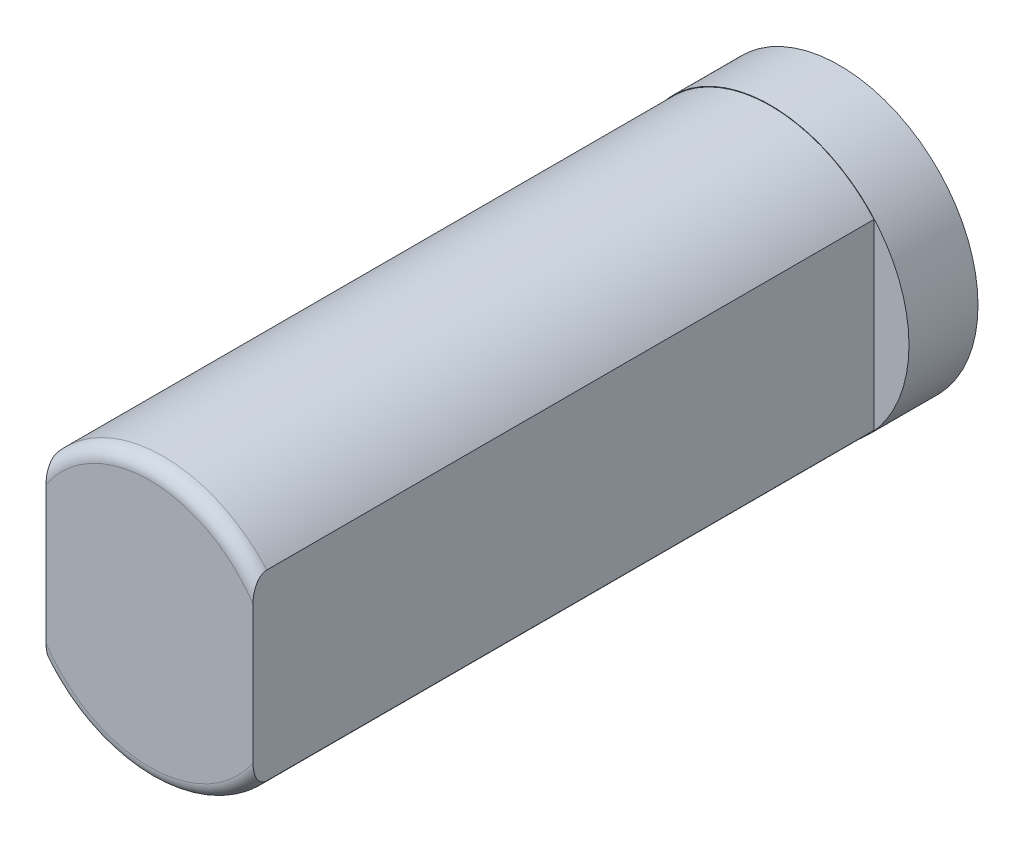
ISO-10303-21;
HEADER;
FILE_DESCRIPTION(('STEP AP214'),'2;1');
FILE_NAME('part.step','',(''),(''),'','','');
FILE_SCHEMA(('AUTOMOTIVE_DESIGN { 1 0 10303 214 1 1 1 1 }'));
ENDSEC;
DATA;
#1=APPLICATION_CONTEXT('core data for automotive mechanical design processes');
#2=APPLICATION_PROTOCOL_DEFINITION('international standard','automotive_design',2000,#1);
#3=PRODUCT_CONTEXT('',#1,'mechanical');
#4=PRODUCT('Part','Part','',(#3));
#5=PRODUCT_RELATED_PRODUCT_CATEGORY('part','',(#4));
#6=PRODUCT_DEFINITION_FORMATION('','',#4);
#7=PRODUCT_DEFINITION_CONTEXT('part definition',#1,'design');
#8=PRODUCT_DEFINITION('design','',#6,#7);
#9=PRODUCT_DEFINITION_SHAPE('','',#8);
#10=(LENGTH_UNIT() NAMED_UNIT(*) SI_UNIT(.MILLI.,.METRE.));
#11=(NAMED_UNIT(*) PLANE_ANGLE_UNIT() SI_UNIT($,.RADIAN.));
#12=(NAMED_UNIT(*) SI_UNIT($,.STERADIAN.) SOLID_ANGLE_UNIT());
#13=UNCERTAINTY_MEASURE_WITH_UNIT(LENGTH_MEASURE(1.E-05),#10,'distance_accuracy_value','');
#14=(GEOMETRIC_REPRESENTATION_CONTEXT(3) GLOBAL_UNCERTAINTY_ASSIGNED_CONTEXT((#13)) GLOBAL_UNIT_ASSIGNED_CONTEXT((#10,
#11,#12)) REPRESENTATION_CONTEXT('',''));
#15=CARTESIAN_POINT('',(0.,0.,0.));
#16=DIRECTION('',(0.,0.,1.));
#17=DIRECTION('',(1.,0.,0.));
#18=AXIS2_PLACEMENT_3D('',#15,#16,#17);
#19=CARTESIAN_POINT('',(0.,0.,10.));
#20=DIRECTION('',(0.,0.,-1.));
#21=DIRECTION('',(-1.,0.,0.));
#22=AXIS2_PLACEMENT_3D('',#19,#20,#21);
#23=CYLINDRICAL_SURFACE('',#22,2.);
#24=CARTESIAN_POINT('',(0.,0.,0.999999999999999));
#25=DIRECTION('',(0.,0.,-1.));
#26=DIRECTION('',(-1.,0.,0.));
#27=AXIS2_PLACEMENT_3D('',#24,#25,#26);
#28=CIRCLE('',#27,2.);
#29=CARTESIAN_POINT('',(-1.5,1.32287565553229,0.999999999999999));
#30=VERTEX_POINT('',#29);
#31=CARTESIAN_POINT('',(1.5,1.3228756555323,0.999999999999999));
#32=VERTEX_POINT('',#31);
#33=EDGE_CURVE('E48',#30,#32,#28,.T.);
#34=ORIENTED_EDGE('',*,*,#33,.F.);
#35=DIRECTION('',(0.,0.,-1.));
#36=VECTOR('',#35,1.);
#37=CARTESIAN_POINT('',(-1.5,1.32287565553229,10.));
#38=LINE('',#37,#36);
#39=CARTESIAN_POINT('',(-1.5,1.32287565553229,9.8));
#40=VERTEX_POINT('',#39);
#41=EDGE_CURVE('E117',#40,#30,#38,.T.);
#42=ORIENTED_EDGE('',*,*,#41,.F.);
#43=CARTESIAN_POINT('',(0.,0.,9.8));
#44=DIRECTION('',(0.,0.,1.));
#45=DIRECTION('',(1.,0.,0.));
#46=AXIS2_PLACEMENT_3D('',#43,#44,#45);
#47=CIRCLE('',#46,2.);
#48=CARTESIAN_POINT('',(1.5,1.3228756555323,9.8));
#49=VERTEX_POINT('',#48);
#50=EDGE_CURVE('E41',#40,#49,#47,.F.);
#51=ORIENTED_EDGE('',*,*,#50,.T.);
#52=DIRECTION('',(0.,0.,-1.));
#53=VECTOR('',#52,1.);
#54=CARTESIAN_POINT('',(1.5,1.3228756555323,10.));
#55=LINE('',#54,#53);
#56=EDGE_CURVE('E97',#49,#32,#55,.T.);
#57=ORIENTED_EDGE('',*,*,#56,.T.);
#58=EDGE_LOOP('',(#34,#42,#51,#57));
#59=FACE_BOUND('',#58,.T.);
#60=ADVANCED_FACE('F32',(#59),#23,.T.);
#61=CARTESIAN_POINT('',(-1.5,1.32287565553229,10.));
#62=DIRECTION('',(1.,0.,0.));
#63=DIRECTION('',(0.,0.,-1.));
#64=AXIS2_PLACEMENT_3D('',#61,#62,#63);
#65=PLANE('',#64);
#66=DIRECTION('',(0.,1.,0.));
#67=VECTOR('',#66,1.);
#68=CARTESIAN_POINT('',(-1.5,1.32287565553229,0.999999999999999));
#69=LINE('',#68,#67);
#70=CARTESIAN_POINT('',(-1.5,-1.32287565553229,0.999999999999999));
#71=VERTEX_POINT('',#70);
#72=EDGE_CURVE('E55',#71,#30,#69,.T.);
#73=ORIENTED_EDGE('',*,*,#72,.F.);
#74=DIRECTION('',(0.,0.,-1.));
#75=VECTOR('',#74,1.);
#76=CARTESIAN_POINT('',(-1.5,-1.32287565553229,10.));
#77=LINE('',#76,#75);
#78=CARTESIAN_POINT('',(-1.5,-1.32287565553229,9.8));
#79=VERTEX_POINT('',#78);
#80=EDGE_CURVE('E96',#79,#71,#77,.T.);
#81=ORIENTED_EDGE('',*,*,#80,.F.);
#82=CARTESIAN_POINT('',(-1.5,-1.32287565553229,9.8));
#83=CARTESIAN_POINT('',(-1.5,-1.32289734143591,9.80855991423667));
#84=CARTESIAN_POINT('',(-1.5,-1.32204643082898,9.81709616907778));
#85=CARTESIAN_POINT('',(-1.5,-1.31878936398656,9.83378765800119));
#86=CARTESIAN_POINT('',(-1.5,-1.31639779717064,9.84194570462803));
#87=CARTESIAN_POINT('',(-1.5,-1.31025251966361,9.85769231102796));
#88=CARTESIAN_POINT('',(-1.5,-1.30650297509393,9.86528252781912));
#89=CARTESIAN_POINT('',(-1.5,-1.29787951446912,9.87980807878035));
#90=CARTESIAN_POINT('',(-1.5,-1.29300286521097,9.88674176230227));
#91=CARTESIAN_POINT('',(-1.5,-1.28003921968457,9.90274983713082));
#92=CARTESIAN_POINT('',(-1.5,-1.27147928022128,9.91144049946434));
#93=CARTESIAN_POINT('',(-1.5,-1.25309795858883,9.92734906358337));
#94=CARTESIAN_POINT('',(-1.5,-1.24327456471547,9.93456456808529));
#95=CARTESIAN_POINT('',(-1.5,-1.2175420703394,9.95097970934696));
#96=CARTESIAN_POINT('',(-1.5,-1.20108425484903,9.95931459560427));
#97=CARTESIAN_POINT('',(-1.5,-1.16705594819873,9.97339027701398));
#98=CARTESIAN_POINT('',(-1.5,-1.1494806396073,9.97911883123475));
#99=CARTESIAN_POINT('',(-1.5,-1.10920343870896,9.98955134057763));
#100=CARTESIAN_POINT('',(-1.5,-1.08634119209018,9.99361733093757));
#101=CARTESIAN_POINT('',(-1.5,-1.04061534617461,9.99880491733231));
#102=CARTESIAN_POINT('',(-1.5,-1.01775676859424,9.99996917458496));
#103=CARTESIAN_POINT('',(-1.5,-0.994987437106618,10.));
#104=B_SPLINE_CURVE_WITH_KNOTS('',3,(#82,#83,#84,#85,#86,#87,#88,#89,#90,#91,#92,#93,#94,#95,
#96,#97,#98,#99,#100,#101,#102,#103),.UNSPECIFIED.,.F.,.F.,(4,2,2,2,2,2,2,2,2,2,4),(0.,
0.0256000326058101,0.0509611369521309,0.0762450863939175,0.10159100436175,0.137981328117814,
0.174430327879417,0.229467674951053,0.284760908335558,0.354212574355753,0.422636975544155),.UNSPECIFIED.);
#105=CARTESIAN_POINT('',(-1.5,-0.994987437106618,10.));
#106=VERTEX_POINT('',#105);
#107=EDGE_CURVE('E156',#79,#106,#104,.T.);
#108=ORIENTED_EDGE('',*,*,#107,.T.);
#109=DIRECTION('',(0.,-1.,0.));
#110=VECTOR('',#109,1.);
#111=CARTESIAN_POINT('',(-1.5,1.32287565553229,10.));
#112=LINE('',#111,#110);
#113=CARTESIAN_POINT('',(-1.5,0.994987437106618,10.));
#114=VERTEX_POINT('',#113);
#115=EDGE_CURVE('E106',#114,#106,#112,.T.);
#116=ORIENTED_EDGE('',*,*,#115,.F.);
#117=CARTESIAN_POINT('',(-1.5,0.994987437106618,10.));
#118=CARTESIAN_POINT('',(-1.5,1.01108869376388,9.99999272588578));
#119=CARTESIAN_POINT('',(-1.5,1.02720569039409,9.99940483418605));
#120=CARTESIAN_POINT('',(-1.5,1.05943512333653,9.99688940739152));
#121=CARTESIAN_POINT('',(-1.5,1.07554688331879,9.99495340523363));
#122=CARTESIAN_POINT('',(-1.5,1.1077519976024,9.98952027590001));
#123=CARTESIAN_POINT('',(-1.5,1.12384175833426,9.98600110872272));
#124=CARTESIAN_POINT('',(-1.5,1.15548512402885,9.97716145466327));
#125=CARTESIAN_POINT('',(-1.5,1.17104016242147,9.9718462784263));
#126=CARTESIAN_POINT('',(-1.5,1.1977280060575,9.96060993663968));
#127=CARTESIAN_POINT('',(-1.5,1.20904227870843,9.9551233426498));
#128=CARTESIAN_POINT('',(-1.5,1.23088528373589,9.94277185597));
#129=CARTESIAN_POINT('',(-1.5,1.24141517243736,9.9359090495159));
#130=CARTESIAN_POINT('',(-1.5,1.26146150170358,9.92055000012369));
#131=CARTESIAN_POINT('',(-1.5,1.27096207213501,9.912032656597));
#132=CARTESIAN_POINT('',(-1.5,1.28818030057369,9.89334599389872));
#133=CARTESIAN_POINT('',(-1.5,1.29590320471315,9.88318169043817));
#134=CARTESIAN_POINT('',(-1.5,1.3064363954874,9.86536546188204));
#135=CARTESIAN_POINT('',(-1.5,1.3100091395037,9.85816236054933));
#136=CARTESIAN_POINT('',(-1.5,1.31593198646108,9.84327456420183));
#137=CARTESIAN_POINT('',(-1.5,1.31828469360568,9.83559093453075));
#138=CARTESIAN_POINT('',(-1.5,1.32091350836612,9.8232069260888));
#139=CARTESIAN_POINT('',(-1.5,1.32164649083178,9.81859992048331));
#140=CARTESIAN_POINT('',(-1.5,1.32262860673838,9.80932969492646));
#141=CARTESIAN_POINT('',(-1.5,1.32287720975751,9.80466641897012));
#142=CARTESIAN_POINT('',(-1.5,1.32287565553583,9.80000000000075));
#143=B_SPLINE_CURVE_WITH_KNOTS('',3,(#117,#118,#119,#120,#121,#122,#123,#124,#125,#126,#127,
#128,#129,#130,#131,#132,#133,#134,#135,#136,#137,#138,#139,#140,#141,#142),.UNSPECIFIED.,.F.,
.F.,(4,2,2,2,2,2,2,2,2,2,2,2,4),(0.,0.0483174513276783,0.0969411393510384,0.146263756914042,
0.195441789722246,0.23308465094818,0.270670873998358,0.308772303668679,0.346759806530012,
0.370791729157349,0.394772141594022,0.408743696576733,0.422730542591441),.UNSPECIFIED.);
#144=EDGE_CURVE('E151',#114,#40,#143,.T.);
#145=ORIENTED_EDGE('',*,*,#144,.T.);
#146=ORIENTED_EDGE('',*,*,#41,.T.);
#147=EDGE_LOOP('',(#73,#81,#108,#116,#145,#146));
#148=FACE_BOUND('',#147,.T.);
#149=ADVANCED_FACE('F145',(#148),#65,.F.);
#150=CARTESIAN_POINT('',(0.,0.,10.));
#151=DIRECTION('',(0.,0.,-1.));
#152=DIRECTION('',(-1.,0.,0.));
#153=AXIS2_PLACEMENT_3D('',#150,#151,#152);
#154=CYLINDRICAL_SURFACE('',#153,2.);
#155=CARTESIAN_POINT('',(0.,0.,0.999999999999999));
#156=DIRECTION('',(0.,0.,-1.));
#157=DIRECTION('',(-1.,0.,0.));
#158=AXIS2_PLACEMENT_3D('',#155,#156,#157);
#159=CIRCLE('',#158,2.);
#160=CARTESIAN_POINT('',(1.5,-1.3228756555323,0.999999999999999));
#161=VERTEX_POINT('',#160);
#162=EDGE_CURVE('E100',#161,#71,#159,.T.);
#163=ORIENTED_EDGE('',*,*,#162,.F.);
#164=DIRECTION('',(0.,0.,-1.));
#165=VECTOR('',#164,1.);
#166=CARTESIAN_POINT('',(1.5,-1.3228756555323,10.));
#167=LINE('',#166,#165);
#168=CARTESIAN_POINT('',(1.5,-1.3228756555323,9.8));
#169=VERTEX_POINT('',#168);
#170=EDGE_CURVE('E88',#169,#161,#167,.T.);
#171=ORIENTED_EDGE('',*,*,#170,.F.);
#172=CARTESIAN_POINT('',(0.,0.,9.8));
#173=DIRECTION('',(0.,0.,1.));
#174=DIRECTION('',(1.,0.,0.));
#175=AXIS2_PLACEMENT_3D('',#172,#173,#174);
#176=CIRCLE('',#175,2.);
#177=EDGE_CURVE('E252',#169,#79,#176,.F.);
#178=ORIENTED_EDGE('',*,*,#177,.T.);
#179=ORIENTED_EDGE('',*,*,#80,.T.);
#180=EDGE_LOOP('',(#163,#171,#178,#179));
#181=FACE_BOUND('',#180,.T.);
#182=ADVANCED_FACE('F101',(#181),#154,.T.);
#183=CARTESIAN_POINT('',(1.5,1.3228756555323,10.));
#184=DIRECTION('',(-1.,0.,0.));
#185=DIRECTION('',(0.,0.,1.));
#186=AXIS2_PLACEMENT_3D('',#183,#184,#185);
#187=PLANE('',#186);
#188=DIRECTION('',(0.,-1.,0.));
#189=VECTOR('',#188,1.);
#190=CARTESIAN_POINT('',(1.5,1.3228756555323,0.999999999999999));
#191=LINE('',#190,#189);
#192=EDGE_CURVE('E11',#32,#161,#191,.T.);
#193=ORIENTED_EDGE('',*,*,#192,.F.);
#194=ORIENTED_EDGE('',*,*,#56,.F.);
#195=CARTESIAN_POINT('',(1.5,1.3228756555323,9.8));
#196=CARTESIAN_POINT('',(1.5,1.32289734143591,9.80855991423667));
#197=CARTESIAN_POINT('',(1.5,1.32204643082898,9.81709616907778));
#198=CARTESIAN_POINT('',(1.5,1.31878936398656,9.83378765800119));
#199=CARTESIAN_POINT('',(1.5,1.31639779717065,9.84194570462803));
#200=CARTESIAN_POINT('',(1.5,1.31025251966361,9.85769231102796));
#201=CARTESIAN_POINT('',(1.5,1.30650297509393,9.86528252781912));
#202=CARTESIAN_POINT('',(1.5,1.29787951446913,9.87980807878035));
#203=CARTESIAN_POINT('',(1.5,1.29300286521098,9.88674176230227));
#204=CARTESIAN_POINT('',(1.5,1.28003921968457,9.90274983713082));
#205=CARTESIAN_POINT('',(1.5,1.27147928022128,9.91144049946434));
#206=CARTESIAN_POINT('',(1.5,1.25309795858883,9.92734906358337));
#207=CARTESIAN_POINT('',(1.5,1.24327456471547,9.93456456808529));
#208=CARTESIAN_POINT('',(1.5,1.2175420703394,9.95097970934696));
#209=CARTESIAN_POINT('',(1.5,1.20108425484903,9.95931459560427));
#210=CARTESIAN_POINT('',(1.5,1.16705594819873,9.97339027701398));
#211=CARTESIAN_POINT('',(1.5,1.1494806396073,9.97911883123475));
#212=CARTESIAN_POINT('',(1.5,1.10920343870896,9.98955134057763));
#213=CARTESIAN_POINT('',(1.5,1.08634119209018,9.99361733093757));
#214=CARTESIAN_POINT('',(1.5,1.04061534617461,9.99880491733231));
#215=CARTESIAN_POINT('',(1.5,1.01775676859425,9.99996917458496));
#216=CARTESIAN_POINT('',(1.5,0.99498743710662,10.));
#217=B_SPLINE_CURVE_WITH_KNOTS('',3,(#195,#196,#197,#198,#199,#200,#201,#202,#203,#204,#205,
#206,#207,#208,#209,#210,#211,#212,#213,#214,#215,#216),.UNSPECIFIED.,.F.,.F.,(4,2,2,2,2,2,2,2,
2,2,4),(0.,0.0256000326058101,0.0509611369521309,0.0762450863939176,0.10159100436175,
0.137981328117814,0.174430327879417,0.229467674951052,0.284760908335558,0.354212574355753,
0.422636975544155),.UNSPECIFIED.);
#218=CARTESIAN_POINT('',(1.5,0.99498743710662,10.));
#219=VERTEX_POINT('',#218);
#220=EDGE_CURVE('E125',#49,#219,#217,.T.);
#221=ORIENTED_EDGE('',*,*,#220,.T.);
#222=DIRECTION('',(0.,1.,0.));
#223=VECTOR('',#222,1.);
#224=CARTESIAN_POINT('',(1.5,1.3228756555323,10.));
#225=LINE('',#224,#223);
#226=CARTESIAN_POINT('',(1.5,-0.994987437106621,10.));
#227=VERTEX_POINT('',#226);
#228=EDGE_CURVE('E109',#227,#219,#225,.T.);
#229=ORIENTED_EDGE('',*,*,#228,.F.);
#230=CARTESIAN_POINT('',(1.5,-0.99498743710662,10.));
#231=CARTESIAN_POINT('',(1.5,-1.01108869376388,9.99999272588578));
#232=CARTESIAN_POINT('',(1.5,-1.02720569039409,9.99940483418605));
#233=CARTESIAN_POINT('',(1.5,-1.05943512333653,9.99688940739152));
#234=CARTESIAN_POINT('',(1.5,-1.0755468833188,9.99495340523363));
#235=CARTESIAN_POINT('',(1.5,-1.1077519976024,9.98952027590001));
#236=CARTESIAN_POINT('',(1.5,-1.12384175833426,9.98600110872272));
#237=CARTESIAN_POINT('',(1.5,-1.15548512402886,9.97716145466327));
#238=CARTESIAN_POINT('',(1.5,-1.17104016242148,9.9718462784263));
#239=CARTESIAN_POINT('',(1.5,-1.1977280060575,9.96060993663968));
#240=CARTESIAN_POINT('',(1.5,-1.20904227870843,9.9551233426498));
#241=CARTESIAN_POINT('',(1.5,-1.2308852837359,9.94277185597));
#242=CARTESIAN_POINT('',(1.5,-1.24141517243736,9.9359090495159));
#243=CARTESIAN_POINT('',(1.5,-1.26146150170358,9.92055000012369));
#244=CARTESIAN_POINT('',(1.5,-1.27096207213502,9.912032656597));
#245=CARTESIAN_POINT('',(1.5,-1.2881803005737,9.89334599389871));
#246=CARTESIAN_POINT('',(1.5,-1.29590320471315,9.88318169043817));
#247=CARTESIAN_POINT('',(1.5,-1.3064363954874,9.86536546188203));
#248=CARTESIAN_POINT('',(1.5,-1.31000913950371,9.85816236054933));
#249=CARTESIAN_POINT('',(1.5,-1.31593198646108,9.84327456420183));
#250=CARTESIAN_POINT('',(1.5,-1.31828469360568,9.83559093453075));
#251=CARTESIAN_POINT('',(1.5,-1.32091350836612,9.82320692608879));
#252=CARTESIAN_POINT('',(1.5,-1.32164649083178,9.81859992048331));
#253=CARTESIAN_POINT('',(1.5,-1.32262860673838,9.80932969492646));
#254=CARTESIAN_POINT('',(1.5,-1.32287720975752,9.80466641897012));
#255=CARTESIAN_POINT('',(1.5,-1.32287565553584,9.80000000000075));
#256=B_SPLINE_CURVE_WITH_KNOTS('',3,(#230,#231,#232,#233,#234,#235,#236,#237,#238,#239,#240,
#241,#242,#243,#244,#245,#246,#247,#248,#249,#250,#251,#252,#253,#254,#255),.UNSPECIFIED.,.F.,
.F.,(4,2,2,2,2,2,2,2,2,2,2,2,4),(0.,0.0483174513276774,0.0969411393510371,0.146263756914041,
0.195441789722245,0.233084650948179,0.270670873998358,0.308772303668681,0.346759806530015,
0.370791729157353,0.394772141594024,0.408743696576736,0.42273054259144),.UNSPECIFIED.);
#257=EDGE_CURVE('E93',#227,#169,#256,.T.);
#258=ORIENTED_EDGE('',*,*,#257,.T.);
#259=ORIENTED_EDGE('',*,*,#170,.T.);
#260=EDGE_LOOP('',(#193,#194,#221,#229,#258,#259));
#261=FACE_BOUND('',#260,.T.);
#262=ADVANCED_FACE('F90',(#261),#187,.F.);
#263=CARTESIAN_POINT('',(0.,0.,10.));
#264=DIRECTION('',(0.,0.,1.));
#265=DIRECTION('',(1.,0.,0.));
#266=AXIS2_PLACEMENT_3D('',#263,#264,#265);
#267=PLANE('',#266);
#268=ORIENTED_EDGE('',*,*,#115,.T.);
#269=CARTESIAN_POINT('',(0.,0.,10.));
#270=DIRECTION('',(0.,0.,1.));
#271=DIRECTION('',(1.,0.,0.));
#272=AXIS2_PLACEMENT_3D('',#269,#270,#271);
#273=CIRCLE('',#272,1.8);
#274=EDGE_CURVE('E122',#106,#227,#273,.T.);
#275=ORIENTED_EDGE('',*,*,#274,.T.);
#276=ORIENTED_EDGE('',*,*,#228,.T.);
#277=CARTESIAN_POINT('',(0.,0.,10.));
#278=DIRECTION('',(0.,0.,1.));
#279=DIRECTION('',(1.,0.,0.));
#280=AXIS2_PLACEMENT_3D('',#277,#278,#279);
#281=CIRCLE('',#280,1.8);
#282=EDGE_CURVE('E119',#219,#114,#281,.T.);
#283=ORIENTED_EDGE('',*,*,#282,.T.);
#284=EDGE_LOOP('',(#268,#275,#276,#283));
#285=FACE_BOUND('',#284,.T.);
#286=ADVANCED_FACE('F139',(#285),#267,.T.);
#287=CARTESIAN_POINT('',(0.,0.,9.8));
#288=DIRECTION('',(0.,0.,1.));
#289=DIRECTION('',(1.,0.,0.));
#290=AXIS2_PLACEMENT_3D('',#287,#288,#289);
#291=TOROIDAL_SURFACE('',#290,1.8,0.2);
#292=ORIENTED_EDGE('',*,*,#107,.F.);
#293=ORIENTED_EDGE('',*,*,#177,.F.);
#294=ORIENTED_EDGE('',*,*,#257,.F.);
#295=ORIENTED_EDGE('',*,*,#274,.F.);
#296=EDGE_LOOP('',(#292,#293,#294,#295));
#297=FACE_BOUND('',#296,.T.);
#298=ADVANCED_FACE('F160',(#297),#291,.T.);
#299=CARTESIAN_POINT('',(0.,0.,9.8));
#300=DIRECTION('',(0.,0.,1.));
#301=DIRECTION('',(1.,0.,0.));
#302=AXIS2_PLACEMENT_3D('',#299,#300,#301);
#303=TOROIDAL_SURFACE('',#302,1.8,0.2);
#304=ORIENTED_EDGE('',*,*,#220,.F.);
#305=ORIENTED_EDGE('',*,*,#50,.F.);
#306=ORIENTED_EDGE('',*,*,#144,.F.);
#307=ORIENTED_EDGE('',*,*,#282,.F.);
#308=EDGE_LOOP('',(#304,#305,#306,#307));
#309=FACE_BOUND('',#308,.T.);
#310=ADVANCED_FACE('F34',(#309),#303,.T.);
#311=CARTESIAN_POINT('',(0.,0.,1.));
#312=DIRECTION('',(0.,0.,-1.));
#313=DIRECTION('',(-1.,0.,0.));
#314=AXIS2_PLACEMENT_3D('',#311,#312,#313);
#315=PLANE('',#314);
#316=CARTESIAN_POINT('',(0.,0.,1.));
#317=DIRECTION('',(0.,0.,-1.));
#318=DIRECTION('',(-1.,0.,0.));
#319=AXIS2_PLACEMENT_3D('',#316,#317,#318);
#320=CIRCLE('',#319,2.00716252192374);
#321=CARTESIAN_POINT('',(-2.00716252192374,0.,1.));
#322=VERTEX_POINT('',#321);
#323=EDGE_CURVE('E103',#322,#322,#320,.T.);
#324=ORIENTED_EDGE('',*,*,#323,.F.);
#325=EDGE_LOOP('',(#324));
#326=FACE_BOUND('',#325,.T.);
#327=ORIENTED_EDGE('',*,*,#72,.T.);
#328=ORIENTED_EDGE('',*,*,#33,.T.);
#329=ORIENTED_EDGE('',*,*,#192,.T.);
#330=ORIENTED_EDGE('',*,*,#162,.T.);
#331=EDGE_LOOP('',(#327,#328,#329,#330));
#332=FACE_BOUND('',#331,.T.);
#333=ADVANCED_FACE('F105',(#326,#332),#315,.F.);
#334=CARTESIAN_POINT('',(0.,0.,1.));
#335=DIRECTION('',(0.,0.,-1.));
#336=DIRECTION('',(-1.,0.,0.));
#337=AXIS2_PLACEMENT_3D('',#334,#335,#336);
#338=CYLINDRICAL_SURFACE('',#337,2.00716252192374);
#339=ORIENTED_EDGE('',*,*,#323,.T.);
#340=EDGE_LOOP('',(#339));
#341=FACE_BOUND('',#340,.T.);
#342=CARTESIAN_POINT('',(0.,0.,0.));
#343=DIRECTION('',(0.,0.,-1.));
#344=DIRECTION('',(-1.,0.,0.));
#345=AXIS2_PLACEMENT_3D('',#342,#343,#344);
#346=CIRCLE('',#345,2.00716252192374);
#347=CARTESIAN_POINT('',(-2.00716252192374,0.,0.));
#348=VERTEX_POINT('',#347);
#349=EDGE_CURVE('E245',#348,#348,#346,.T.);
#350=ORIENTED_EDGE('',*,*,#349,.F.);
#351=EDGE_LOOP('',(#350));
#352=FACE_BOUND('',#351,.T.);
#353=ADVANCED_FACE('F210',(#341,#352),#338,.T.);
#354=CARTESIAN_POINT('',(0.,0.,0.));
#355=DIRECTION('',(0.,0.,1.));
#356=DIRECTION('',(1.,0.,0.));
#357=AXIS2_PLACEMENT_3D('',#354,#355,#356);
#358=PLANE('',#357);
#359=ORIENTED_EDGE('',*,*,#349,.T.);
#360=EDGE_LOOP('',(#359));
#361=FACE_BOUND('',#360,.T.);
#362=ADVANCED_FACE('F140',(#361),#358,.F.);
#363=CLOSED_SHELL('',(#60,#149,#182,#262,#286,#298,#310,#333,#353,#362));
#364=MANIFOLD_SOLID_BREP('B2',#363);
#365=ADVANCED_BREP_SHAPE_REPRESENTATION('',(#18,#364),#14);
#366=SHAPE_DEFINITION_REPRESENTATION(#9,#365);
ENDSEC;
END-ISO-10303-21;
